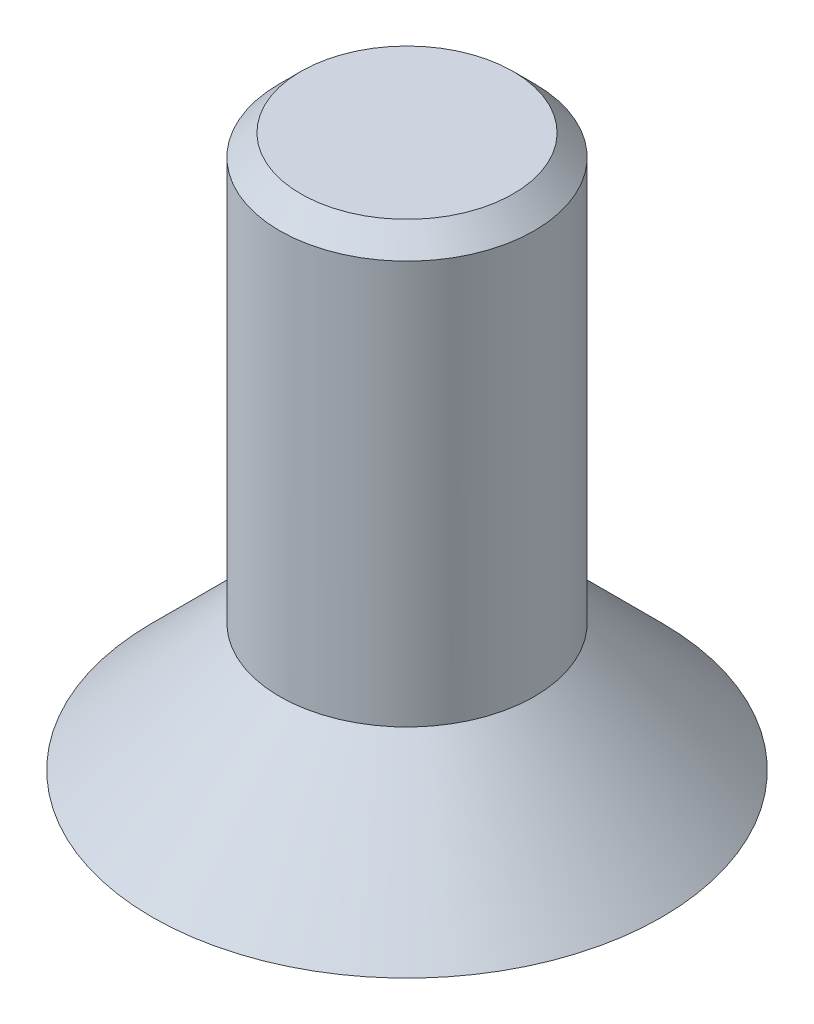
ISO-10303-21;
HEADER;
FILE_DESCRIPTION(('STEP AP214'),'2;1');
FILE_NAME('part.step','',(''),(''),'','','');
FILE_SCHEMA(('AUTOMOTIVE_DESIGN { 1 0 10303 214 1 1 1 1 }'));
ENDSEC;
DATA;
#1=APPLICATION_CONTEXT('core data for automotive mechanical design processes');
#2=APPLICATION_PROTOCOL_DEFINITION('international standard','automotive_design',2000,#1);
#3=PRODUCT_CONTEXT('',#1,'mechanical');
#4=PRODUCT('Part','Part','',(#3));
#5=PRODUCT_RELATED_PRODUCT_CATEGORY('part','',(#4));
#6=PRODUCT_DEFINITION_FORMATION('','',#4);
#7=PRODUCT_DEFINITION_CONTEXT('part definition',#1,'design');
#8=PRODUCT_DEFINITION('design','',#6,#7);
#9=PRODUCT_DEFINITION_SHAPE('','',#8);
#10=(LENGTH_UNIT() NAMED_UNIT(*) SI_UNIT(.MILLI.,.METRE.));
#11=(NAMED_UNIT(*) PLANE_ANGLE_UNIT() SI_UNIT($,.RADIAN.));
#12=(NAMED_UNIT(*) SI_UNIT($,.STERADIAN.) SOLID_ANGLE_UNIT());
#13=UNCERTAINTY_MEASURE_WITH_UNIT(LENGTH_MEASURE(1.E-05),#10,'distance_accuracy_value','');
#14=(GEOMETRIC_REPRESENTATION_CONTEXT(3) GLOBAL_UNCERTAINTY_ASSIGNED_CONTEXT((#13)) GLOBAL_UNIT_ASSIGNED_CONTEXT((#10,
#11,#12)) REPRESENTATION_CONTEXT('',''));
#15=CARTESIAN_POINT('',(0.,0.,0.));
#16=DIRECTION('',(0.,0.,1.));
#17=DIRECTION('',(1.,0.,0.));
#18=AXIS2_PLACEMENT_3D('',#15,#16,#17);
#19=CARTESIAN_POINT('',(2.17570116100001,-19.58,2.49074777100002));
#20=DIRECTION('',(0.,-1.,0.));
#21=DIRECTION('',(-0.990343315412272,0.,-0.138636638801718));
#22=AXIS2_PLACEMENT_3D('',#19,#20,#21);
#23=PLANE('',#22);
#24=DIRECTION('',(-0.990343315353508,0.,-0.138636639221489));
#25=VECTOR('',#24,1.);
#26=CARTESIAN_POINT('',(0.300157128,-19.58,-2.144156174));
#27=LINE('',#26,#25);
#28=CARTESIAN_POINT('',(1.53808627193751,-19.58,-1.970860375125));
#29=VERTEX_POINT('',#28);
#30=CARTESIAN_POINT('',(-0.937772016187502,-19.58,-2.31745197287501));
#31=VERTEX_POINT('',#30);
#32=EDGE_CURVE('E114',#29,#31,#27,.T.);
#33=ORIENTED_EDGE('',*,*,#32,.F.);
#34=DIRECTION('',(-0.37510880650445,0.,-0.92698078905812));
#35=VECTOR('',#34,1.);
#36=CARTESIAN_POINT('',(2.00697228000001,-19.58,-0.812134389));
#37=LINE('',#36,#35);
#38=CARTESIAN_POINT('',(2.4758582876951,-19.58,0.346591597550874));
#39=VERTEX_POINT('',#38);
#40=EDGE_CURVE('E98',#39,#29,#37,.T.);
#41=ORIENTED_EDGE('',*,*,#40,.F.);
#42=DIRECTION('',(0.615234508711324,0.,-0.788344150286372));
#43=VECTOR('',#42,1.);
#44=CARTESIAN_POINT('',(1.70681515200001,-19.58,1.33202178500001));
#45=LINE('',#44,#43);
#46=CARTESIAN_POINT('',(0.937772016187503,-19.58,2.31745197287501));
#47=VERTEX_POINT('',#46);
#48=EDGE_CURVE('E96',#47,#39,#45,.T.);
#49=ORIENTED_EDGE('',*,*,#48,.F.);
#50=DIRECTION('',(0.990343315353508,0.,0.138636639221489));
#51=VECTOR('',#50,1.);
#52=CARTESIAN_POINT('',(-0.300157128,-19.58,2.14415617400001));
#53=LINE('',#52,#51);
#54=CARTESIAN_POINT('',(-1.538086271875,-19.58,1.97086037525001));
#55=VERTEX_POINT('',#54);
#56=EDGE_CURVE('E87',#55,#47,#53,.T.);
#57=ORIENTED_EDGE('',*,*,#56,.F.);
#58=DIRECTION('',(0.37510880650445,0.,0.92698078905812));
#59=VECTOR('',#58,1.);
#60=CARTESIAN_POINT('',(-2.00697228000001,-19.58,0.812134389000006));
#61=LINE('',#60,#59);
#62=CARTESIAN_POINT('',(-2.47585828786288,-19.58,-0.346591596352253));
#63=VERTEX_POINT('',#62);
#64=EDGE_CURVE('E138',#63,#55,#61,.T.);
#65=ORIENTED_EDGE('',*,*,#64,.F.);
#66=DIRECTION('',(-0.615234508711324,0.,0.788344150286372));
#67=VECTOR('',#66,1.);
#68=CARTESIAN_POINT('',(-1.70681515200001,-19.58,-1.332021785));
#69=LINE('',#68,#67);
#70=EDGE_CURVE('E143',#31,#63,#69,.T.);
#71=ORIENTED_EDGE('',*,*,#70,.F.);
#72=EDGE_LOOP('',(#33,#41,#49,#57,#65,#71));
#73=FACE_BOUND('',#72,.T.);
#74=ADVANCED_FACE('F32',(#73),#23,.T.);
#75=CARTESIAN_POINT('',(-1.53808627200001,-22.,1.97086037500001));
#76=DIRECTION('',(0.138636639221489,0.,-0.990343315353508));
#77=DIRECTION('',(0.,1.,0.));
#78=AXIS2_PLACEMENT_3D('',#75,#76,#77);
#79=PLANE('',#78);
#80=ORIENTED_EDGE('',*,*,#56,.T.);
#81=DIRECTION('',(0.,1.,0.));
#82=VECTOR('',#81,1.);
#83=CARTESIAN_POINT('',(0.937772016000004,-20.79,2.31745197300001));
#84=LINE('',#83,#82);
#85=CARTESIAN_POINT('',(0.937772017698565,-22.,2.31745197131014));
#86=VERTEX_POINT('',#85);
#87=EDGE_CURVE('E64',#86,#47,#84,.T.);
#88=ORIENTED_EDGE('',*,*,#87,.F.);
#89=DIRECTION('',(0.990343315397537,0.,0.138636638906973));
#90=VECTOR('',#89,1.);
#91=CARTESIAN_POINT('',(-0.300157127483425,-22.,2.1441561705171));
#92=LINE('',#91,#90);
#93=CARTESIAN_POINT('',(-1.53808627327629,-22.,1.97086037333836));
#94=VERTEX_POINT('',#93);
#95=EDGE_CURVE('E70',#94,#86,#92,.T.);
#96=ORIENTED_EDGE('',*,*,#95,.F.);
#97=DIRECTION('',(0.,-1.,0.));
#98=VECTOR('',#97,1.);
#99=CARTESIAN_POINT('',(-1.53808627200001,-20.79,1.97086037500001));
#100=LINE('',#99,#98);
#101=EDGE_CURVE('E90',#55,#94,#100,.T.);
#102=ORIENTED_EDGE('',*,*,#101,.F.);
#103=EDGE_LOOP('',(#80,#88,#96,#102));
#104=FACE_BOUND('',#103,.T.);
#105=ADVANCED_FACE('F89',(#104),#79,.T.);
#106=CARTESIAN_POINT('',(2.47585828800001,-22.,0.346591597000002));
#107=DIRECTION('',(-0.788344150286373,0.,-0.615234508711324));
#108=DIRECTION('',(-0.615234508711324,0.,0.788344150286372));
#109=AXIS2_PLACEMENT_3D('',#106,#107,#108);
#110=PLANE('',#109);
#111=ORIENTED_EDGE('',*,*,#48,.T.);
#112=DIRECTION('',(0.,1.,0.));
#113=VECTOR('',#112,1.);
#114=CARTESIAN_POINT('',(2.47585828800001,-20.79,0.346591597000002));
#115=LINE('',#114,#113);
#116=CARTESIAN_POINT('',(2.47585829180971,-22.,0.346591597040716));
#117=VERTEX_POINT('',#116);
#118=EDGE_CURVE('E101',#117,#39,#115,.T.);
#119=ORIENTED_EDGE('',*,*,#118,.F.);
#120=DIRECTION('',(0.615234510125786,0.,-0.788344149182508));
#121=VECTOR('',#120,1.);
#122=CARTESIAN_POINT('',(0.937772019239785,-22.,2.31745196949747));
#123=LINE('',#122,#121);
#124=EDGE_CURVE('E105',#86,#117,#123,.T.);
#125=ORIENTED_EDGE('',*,*,#124,.F.);
#126=ORIENTED_EDGE('',*,*,#87,.T.);
#127=EDGE_LOOP('',(#111,#119,#125,#126));
#128=FACE_BOUND('',#127,.T.);
#129=ADVANCED_FACE('F103',(#128),#110,.T.);
#130=CARTESIAN_POINT('',(1.53808627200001,-22.,-1.970860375));
#131=DIRECTION('',(-0.92698078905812,0.,0.37510880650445));
#132=DIRECTION('',(0.37510880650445,0.,0.92698078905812));
#133=AXIS2_PLACEMENT_3D('',#130,#131,#132);
#134=PLANE('',#133);
#135=ORIENTED_EDGE('',*,*,#40,.T.);
#136=DIRECTION('',(0.,1.,0.));
#137=VECTOR('',#136,1.);
#138=CARTESIAN_POINT('',(1.538086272,-20.79,-1.97086037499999));
#139=LINE('',#138,#137);
#140=CARTESIAN_POINT('',(1.53808627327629,-22.,-1.97086037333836));
#141=VERTEX_POINT('',#140);
#142=EDGE_CURVE('E111',#141,#29,#139,.T.);
#143=ORIENTED_EDGE('',*,*,#142,.F.);
#144=DIRECTION('',(-0.37510880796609,0.,-0.926980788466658));
#145=VECTOR('',#144,1.);
#146=CARTESIAN_POINT('',(2.47585829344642,-22.,0.346591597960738));
#147=LINE('',#146,#145);
#148=EDGE_CURVE('E126',#117,#141,#147,.T.);
#149=ORIENTED_EDGE('',*,*,#148,.F.);
#150=ORIENTED_EDGE('',*,*,#118,.T.);
#151=EDGE_LOOP('',(#135,#143,#149,#150));
#152=FACE_BOUND('',#151,.T.);
#153=ADVANCED_FACE('F157',(#152),#134,.T.);
#154=CARTESIAN_POINT('',(-0.937772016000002,-19.58,-2.317451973));
#155=DIRECTION('',(-0.138636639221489,0.,0.990343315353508));
#156=DIRECTION('',(0.,-1.,0.));
#157=AXIS2_PLACEMENT_3D('',#154,#155,#156);
#158=PLANE('',#157);
#159=ORIENTED_EDGE('',*,*,#32,.T.);
#160=DIRECTION('',(0.,1.,0.));
#161=VECTOR('',#160,1.);
#162=CARTESIAN_POINT('',(-0.937772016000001,-20.79,-2.317451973));
#163=LINE('',#162,#161);
#164=CARTESIAN_POINT('',(-0.937772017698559,-22.,-2.31745197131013));
#165=VERTEX_POINT('',#164);
#166=EDGE_CURVE('E140',#165,#31,#163,.T.);
#167=ORIENTED_EDGE('',*,*,#166,.F.);
#168=DIRECTION('',(-0.990343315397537,0.,-0.138636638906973));
#169=VECTOR('',#168,1.);
#170=CARTESIAN_POINT('',(0.300157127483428,-22.,-2.14415617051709));
#171=LINE('',#170,#169);
#172=EDGE_CURVE('E125',#141,#165,#171,.T.);
#173=ORIENTED_EDGE('',*,*,#172,.F.);
#174=ORIENTED_EDGE('',*,*,#142,.T.);
#175=EDGE_LOOP('',(#159,#167,#173,#174));
#176=FACE_BOUND('',#175,.T.);
#177=ADVANCED_FACE('F153',(#176),#158,.T.);
#178=CARTESIAN_POINT('',(-2.47585828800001,-22.,-0.346591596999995));
#179=DIRECTION('',(0.788344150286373,0.,0.615234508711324));
#180=DIRECTION('',(0.615234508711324,0.,-0.788344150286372));
#181=AXIS2_PLACEMENT_3D('',#178,#179,#180);
#182=PLANE('',#181);
#183=ORIENTED_EDGE('',*,*,#70,.T.);
#184=DIRECTION('',(0.,1.,0.));
#185=VECTOR('',#184,1.);
#186=CARTESIAN_POINT('',(-2.47585828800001,-20.79,-0.346591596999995));
#187=LINE('',#186,#185);
#188=CARTESIAN_POINT('',(-2.47585829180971,-22.,-0.346591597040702));
#189=VERTEX_POINT('',#188);
#190=EDGE_CURVE('E49',#189,#63,#187,.T.);
#191=ORIENTED_EDGE('',*,*,#190,.F.);
#192=DIRECTION('',(-0.615234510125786,0.,0.788344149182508));
#193=VECTOR('',#192,1.);
#194=CARTESIAN_POINT('',(-0.93777201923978,-22.,-2.31745196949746));
#195=LINE('',#194,#193);
#196=EDGE_CURVE('E122',#165,#189,#195,.T.);
#197=ORIENTED_EDGE('',*,*,#196,.F.);
#198=ORIENTED_EDGE('',*,*,#166,.T.);
#199=EDGE_LOOP('',(#183,#191,#197,#198));
#200=FACE_BOUND('',#199,.T.);
#201=ADVANCED_FACE('F150',(#200),#182,.T.);
#202=CARTESIAN_POINT('',(-1.53808627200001,-22.,1.97086037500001));
#203=DIRECTION('',(0.92698078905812,0.,-0.37510880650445));
#204=DIRECTION('',(-0.37510880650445,0.,-0.92698078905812));
#205=AXIS2_PLACEMENT_3D('',#202,#203,#204);
#206=PLANE('',#205);
#207=ORIENTED_EDGE('',*,*,#64,.T.);
#208=ORIENTED_EDGE('',*,*,#101,.T.);
#209=DIRECTION('',(0.375108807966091,0.,0.926980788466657));
#210=VECTOR('',#209,1.);
#211=CARTESIAN_POINT('',(-2.47585829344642,-22.,-0.346591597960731));
#212=LINE('',#211,#210);
#213=EDGE_CURVE('E119',#189,#94,#212,.T.);
#214=ORIENTED_EDGE('',*,*,#213,.F.);
#215=ORIENTED_EDGE('',*,*,#190,.T.);
#216=EDGE_LOOP('',(#207,#208,#214,#215));
#217=FACE_BOUND('',#216,.T.);
#218=ADVANCED_FACE('F148',(#217),#206,.T.);
#219=CARTESIAN_POINT('',(5.17156294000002,-22.,6.85516628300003));
#220=DIRECTION('',(0.,-1.,0.));
#221=DIRECTION('',(-0.990343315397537,0.,-0.138636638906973));
#222=AXIS2_PLACEMENT_3D('',#219,#220,#221);
#223=PLANE('',#222);
#224=ORIENTED_EDGE('',*,*,#196,.T.);
#225=ORIENTED_EDGE('',*,*,#213,.T.);
#226=ORIENTED_EDGE('',*,*,#95,.T.);
#227=ORIENTED_EDGE('',*,*,#124,.T.);
#228=ORIENTED_EDGE('',*,*,#148,.T.);
#229=ORIENTED_EDGE('',*,*,#172,.T.);
#230=EDGE_LOOP('',(#224,#225,#226,#227,#228,#229));
#231=FACE_BOUND('',#230,.T.);
#232=CARTESIAN_POINT('',(0.,-22.,0.));
#233=DIRECTION('',(0.,-1.,0.));
#234=DIRECTION('',(0.,0.,-1.));
#235=AXIS2_PLACEMENT_3D('',#232,#233,#234);
#236=CIRCLE('',#235,5.99999999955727);
#237=CARTESIAN_POINT('',(0.,-22.,-5.99999999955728));
#238=VERTEX_POINT('',#237);
#239=EDGE_CURVE('E115',#238,#238,#236,.T.);
#240=ORIENTED_EDGE('',*,*,#239,.T.);
#241=EDGE_LOOP('',(#240));
#242=FACE_BOUND('',#241,.T.);
#243=ADVANCED_FACE('F159',(#231,#242),#223,.T.);
#244=CARTESIAN_POINT('',(0.,-19.,0.));
#245=DIRECTION('',(0.,-1.,0.));
#246=DIRECTION('',(0.,0.,-1.));
#247=AXIS2_PLACEMENT_3D('',#244,#245,#246);
#248=CONICAL_SURFACE('',#247,2.99999999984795,0.785398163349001);
#249=ORIENTED_EDGE('',*,*,#239,.F.);
#250=EDGE_LOOP('',(#249));
#251=FACE_BOUND('',#250,.T.);
#252=CARTESIAN_POINT('',(0.,-19.,0.));
#253=DIRECTION('',(0.,-1.,0.));
#254=DIRECTION('',(-0.99034331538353,0.,-0.138636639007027));
#255=AXIS2_PLACEMENT_3D('',#252,#253,#254);
#256=CIRCLE('',#255,2.99999999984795);
#257=CARTESIAN_POINT('',(-2.97102994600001,-19.,-0.415909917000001));
#258=VERTEX_POINT('',#257);
#259=EDGE_CURVE('E118',#258,#258,#256,.T.);
#260=ORIENTED_EDGE('',*,*,#259,.T.);
#261=EDGE_LOOP('',(#260));
#262=FACE_BOUND('',#261,.T.);
#263=ADVANCED_FACE('F162',(#251,#262),#248,.T.);
#264=CARTESIAN_POINT('',(0.,-10.,0.));
#265=DIRECTION('',(0.,-1.,0.));
#266=DIRECTION('',(0.,0.,-1.));
#267=AXIS2_PLACEMENT_3D('',#264,#265,#266);
#268=CYLINDRICAL_SURFACE('',#267,2.99999999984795);
#269=CARTESIAN_POINT('',(0.,-9.49999999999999,0.));
#270=DIRECTION('',(0.,1.,0.));
#271=DIRECTION('',(0.,0.,1.));
#272=AXIS2_PLACEMENT_3D('',#269,#270,#271);
#273=CIRCLE('',#272,2.99999999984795);
#274=CARTESIAN_POINT('',(0.,-9.49999999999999,2.99999999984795));
#275=VERTEX_POINT('',#274);
#276=EDGE_CURVE('E11',#275,#275,#273,.F.);
#277=ORIENTED_EDGE('',*,*,#276,.T.);
#278=EDGE_LOOP('',(#277));
#279=FACE_BOUND('',#278,.T.);
#280=ORIENTED_EDGE('',*,*,#259,.F.);
#281=EDGE_LOOP('',(#280));
#282=FACE_BOUND('',#281,.T.);
#283=ADVANCED_FACE('F166',(#279,#282),#268,.T.);
#284=CARTESIAN_POINT('',(-2.28505542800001,-9.,1.72385431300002));
#285=DIRECTION('',(0.,1.,0.));
#286=DIRECTION('',(0.990343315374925,0.,0.138636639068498));
#287=AXIS2_PLACEMENT_3D('',#284,#285,#286);
#288=PLANE('',#287);
#289=CARTESIAN_POINT('',(0.,-9.,0.));
#290=DIRECTION('',(0.,1.,0.));
#291=DIRECTION('',(-1.,0.,0.));
#292=AXIS2_PLACEMENT_3D('',#289,#290,#291);
#293=CIRCLE('',#292,2.49999999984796);
#294=CARTESIAN_POINT('',(-2.49999999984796,-9.,0.));
#295=VERTEX_POINT('',#294);
#296=EDGE_CURVE('E41',#295,#295,#293,.T.);
#297=ORIENTED_EDGE('',*,*,#296,.T.);
#298=EDGE_LOOP('',(#297));
#299=FACE_BOUND('',#298,.T.);
#300=ADVANCED_FACE('F34',(#299),#288,.T.);
#301=CARTESIAN_POINT('',(0.,-9.,0.));
#302=DIRECTION('',(0.,-1.,0.));
#303=DIRECTION('',(0.,0.,-1.));
#304=AXIS2_PLACEMENT_3D('',#301,#302,#303);
#305=CONICAL_SURFACE('',#304,2.49999999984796,0.785398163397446);
#306=ORIENTED_EDGE('',*,*,#276,.F.);
#307=EDGE_LOOP('',(#306));
#308=FACE_BOUND('',#307,.T.);
#309=ORIENTED_EDGE('',*,*,#296,.F.);
#310=EDGE_LOOP('',(#309));
#311=FACE_BOUND('',#310,.T.);
#312=ADVANCED_FACE('F174',(#308,#311),#305,.T.);
#313=CLOSED_SHELL('',(#74,#105,#129,#153,#177,#201,#218,#243,#263,#283,#300,#312));
#314=MANIFOLD_SOLID_BREP('B2',#313);
#315=ADVANCED_BREP_SHAPE_REPRESENTATION('',(#18,#314),#14);
#316=SHAPE_DEFINITION_REPRESENTATION(#9,#315);
ENDSEC;
END-ISO-10303-21;
